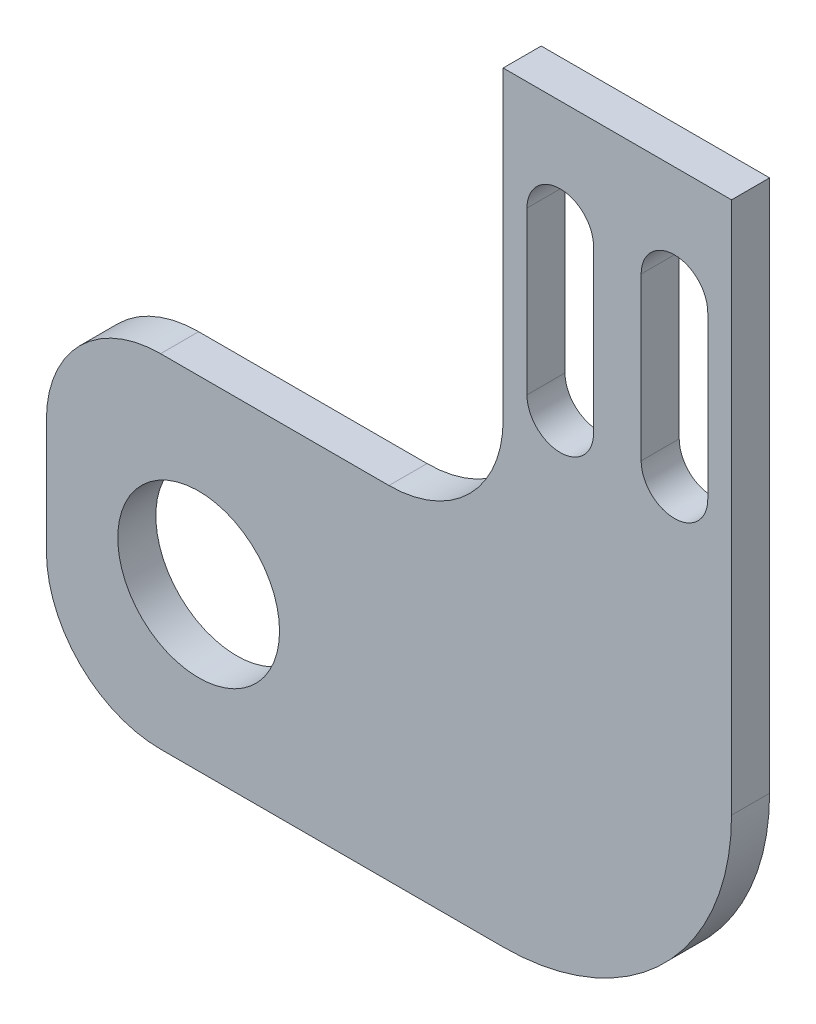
ISO-10303-21;
HEADER;
FILE_DESCRIPTION(('STEP AP214'),'2;1');
FILE_NAME('part.step','',(''),(''),'','','');
FILE_SCHEMA(('AUTOMOTIVE_DESIGN { 1 0 10303 214 1 1 1 1 }'));
ENDSEC;
DATA;
#1=APPLICATION_CONTEXT('core data for automotive mechanical design processes');
#2=APPLICATION_PROTOCOL_DEFINITION('international standard','automotive_design',2000,#1);
#3=PRODUCT_CONTEXT('',#1,'mechanical');
#4=PRODUCT('Part','Part','',(#3));
#5=PRODUCT_RELATED_PRODUCT_CATEGORY('part','',(#4));
#6=PRODUCT_DEFINITION_FORMATION('','',#4);
#7=PRODUCT_DEFINITION_CONTEXT('part definition',#1,'design');
#8=PRODUCT_DEFINITION('design','',#6,#7);
#9=PRODUCT_DEFINITION_SHAPE('','',#8);
#10=(LENGTH_UNIT() NAMED_UNIT(*) SI_UNIT(.MILLI.,.METRE.));
#11=(NAMED_UNIT(*) PLANE_ANGLE_UNIT() SI_UNIT($,.RADIAN.));
#12=(NAMED_UNIT(*) SI_UNIT($,.STERADIAN.) SOLID_ANGLE_UNIT());
#13=UNCERTAINTY_MEASURE_WITH_UNIT(LENGTH_MEASURE(1.E-05),#10,'distance_accuracy_value','');
#14=(GEOMETRIC_REPRESENTATION_CONTEXT(3) GLOBAL_UNCERTAINTY_ASSIGNED_CONTEXT((#13)) GLOBAL_UNIT_ASSIGNED_CONTEXT((#10,
#11,#12)) REPRESENTATION_CONTEXT('',''));
#15=CARTESIAN_POINT('',(0.,0.,0.));
#16=DIRECTION('',(0.,0.,1.));
#17=DIRECTION('',(1.,0.,0.));
#18=AXIS2_PLACEMENT_3D('',#15,#16,#17);
#19=CARTESIAN_POINT('',(-2.,20.,-2.));
#20=DIRECTION('',(1.,0.,0.));
#21=DIRECTION('',(0.,0.,-1.));
#22=AXIS2_PLACEMENT_3D('',#19,#20,#21);
#23=PLANE('',#22);
#24=DIRECTION('',(0.,1.,0.));
#25=VECTOR('',#24,1.);
#26=CARTESIAN_POINT('',(-2.,20.,0.));
#27=LINE('',#26,#25);
#28=CARTESIAN_POINT('',(-2.,-8.,0.));
#29=VERTEX_POINT('',#28);
#30=CARTESIAN_POINT('',(-2.,20.,0.));
#31=VERTEX_POINT('',#30);
#32=EDGE_CURVE('E208',#29,#31,#27,.T.);
#33=ORIENTED_EDGE('',*,*,#32,.F.);
#34=DIRECTION('',(0.,0.,1.));
#35=VECTOR('',#34,1.);
#36=CARTESIAN_POINT('',(-2.,-8.,-2.));
#37=LINE('',#36,#35);
#38=CARTESIAN_POINT('',(-2.,-8.,-2.));
#39=VERTEX_POINT('',#38);
#40=EDGE_CURVE('E24',#29,#39,#37,.F.);
#41=ORIENTED_EDGE('',*,*,#40,.T.);
#42=DIRECTION('',(0.,1.,0.));
#43=VECTOR('',#42,1.);
#44=CARTESIAN_POINT('',(-2.,20.,-2.));
#45=LINE('',#44,#43);
#46=CARTESIAN_POINT('',(-2.,20.,-2.));
#47=VERTEX_POINT('',#46);
#48=EDGE_CURVE('E209',#39,#47,#45,.T.);
#49=ORIENTED_EDGE('',*,*,#48,.T.);
#50=DIRECTION('',(0.,0.,1.));
#51=VECTOR('',#50,1.);
#52=CARTESIAN_POINT('',(-2.,20.,-2.));
#53=LINE('',#52,#51);
#54=EDGE_CURVE('E227',#47,#31,#53,.T.);
#55=ORIENTED_EDGE('',*,*,#54,.T.);
#56=EDGE_LOOP('',(#33,#41,#49,#55));
#57=FACE_BOUND('',#56,.T.);
#58=ADVANCED_FACE('F16',(#57),#23,.T.);
#59=CARTESIAN_POINT('',(-2.,-20.,-2.));
#60=DIRECTION('',(0.,-1.,0.));
#61=DIRECTION('',(0.,0.,-1.));
#62=AXIS2_PLACEMENT_3D('',#59,#60,#61);
#63=PLANE('',#62);
#64=DIRECTION('',(1.,0.,0.));
#65=VECTOR('',#64,1.);
#66=CARTESIAN_POINT('',(-2.,-20.,-2.));
#67=LINE('',#66,#65);
#68=CARTESIAN_POINT('',(-32.,-20.,-2.));
#69=VERTEX_POINT('',#68);
#70=CARTESIAN_POINT('',(-14.,-20.,-2.));
#71=VERTEX_POINT('',#70);
#72=EDGE_CURVE('E224',#69,#71,#67,.T.);
#73=ORIENTED_EDGE('',*,*,#72,.T.);
#74=DIRECTION('',(0.,0.,1.));
#75=VECTOR('',#74,1.);
#76=CARTESIAN_POINT('',(-14.,-20.,-2.));
#77=LINE('',#76,#75);
#78=CARTESIAN_POINT('',(-14.,-20.,0.));
#79=VERTEX_POINT('',#78);
#80=EDGE_CURVE('E274',#71,#79,#77,.T.);
#81=ORIENTED_EDGE('',*,*,#80,.T.);
#82=DIRECTION('',(1.,0.,0.));
#83=VECTOR('',#82,1.);
#84=CARTESIAN_POINT('',(-2.,-20.,0.));
#85=LINE('',#84,#83);
#86=CARTESIAN_POINT('',(-32.,-20.,0.));
#87=VERTEX_POINT('',#86);
#88=EDGE_CURVE('E212',#87,#79,#85,.T.);
#89=ORIENTED_EDGE('',*,*,#88,.F.);
#90=DIRECTION('',(0.,0.,1.));
#91=VECTOR('',#90,1.);
#92=CARTESIAN_POINT('',(-32.,-20.,-2.));
#93=LINE('',#92,#91);
#94=EDGE_CURVE('E268',#87,#69,#93,.F.);
#95=ORIENTED_EDGE('',*,*,#94,.T.);
#96=EDGE_LOOP('',(#73,#81,#89,#95));
#97=FACE_BOUND('',#96,.T.);
#98=ADVANCED_FACE('F292',(#97),#63,.T.);
#99=CARTESIAN_POINT('',(-38.,-2.,-2.));
#100=DIRECTION('',(-1.,0.,0.));
#101=DIRECTION('',(0.,-1.,0.));
#102=AXIS2_PLACEMENT_3D('',#99,#100,#101);
#103=PLANE('',#102);
#104=DIRECTION('',(0.,-1.,0.));
#105=VECTOR('',#104,1.);
#106=CARTESIAN_POINT('',(-38.,-2.,0.));
#107=LINE('',#106,#105);
#108=CARTESIAN_POINT('',(-38.,-8.,0.));
#109=VERTEX_POINT('',#108);
#110=CARTESIAN_POINT('',(-38.,-14.,0.));
#111=VERTEX_POINT('',#110);
#112=EDGE_CURVE('E238',#109,#111,#107,.T.);
#113=ORIENTED_EDGE('',*,*,#112,.F.);
#114=DIRECTION('',(0.,0.,1.));
#115=VECTOR('',#114,1.);
#116=CARTESIAN_POINT('',(-38.,-8.,-2.));
#117=LINE('',#116,#115);
#118=CARTESIAN_POINT('',(-38.,-8.,-2.));
#119=VERTEX_POINT('',#118);
#120=EDGE_CURVE('E262',#109,#119,#117,.F.);
#121=ORIENTED_EDGE('',*,*,#120,.T.);
#122=DIRECTION('',(0.,-1.,0.));
#123=VECTOR('',#122,1.);
#124=CARTESIAN_POINT('',(-38.,-2.,-2.));
#125=LINE('',#124,#123);
#126=CARTESIAN_POINT('',(-38.,-14.,-2.));
#127=VERTEX_POINT('',#126);
#128=EDGE_CURVE('E221',#119,#127,#125,.T.);
#129=ORIENTED_EDGE('',*,*,#128,.T.);
#130=DIRECTION('',(0.,0.,1.));
#131=VECTOR('',#130,1.);
#132=CARTESIAN_POINT('',(-38.,-14.,-2.));
#133=LINE('',#132,#131);
#134=EDGE_CURVE('E259',#127,#111,#133,.T.);
#135=ORIENTED_EDGE('',*,*,#134,.T.);
#136=EDGE_LOOP('',(#113,#121,#129,#135));
#137=FACE_BOUND('',#136,.T.);
#138=ADVANCED_FACE('F302',(#137),#103,.T.);
#139=CARTESIAN_POINT('',(-38.,-2.,-2.));
#140=DIRECTION('',(0.,1.,0.));
#141=DIRECTION('',(0.,0.,1.));
#142=AXIS2_PLACEMENT_3D('',#139,#140,#141);
#143=PLANE('',#142);
#144=DIRECTION('',(-1.,0.,0.));
#145=VECTOR('',#144,1.);
#146=CARTESIAN_POINT('',(-38.,-2.,0.));
#147=LINE('',#146,#145);
#148=CARTESIAN_POINT('',(-20.,-2.,0.));
#149=VERTEX_POINT('',#148);
#150=CARTESIAN_POINT('',(-32.,-2.,0.));
#151=VERTEX_POINT('',#150);
#152=EDGE_CURVE('E235',#149,#151,#147,.T.);
#153=ORIENTED_EDGE('',*,*,#152,.F.);
#154=DIRECTION('',(0.,0.,1.));
#155=VECTOR('',#154,1.);
#156=CARTESIAN_POINT('',(-20.,-2.,-2.));
#157=LINE('',#156,#155);
#158=CARTESIAN_POINT('',(-20.,-2.,-2.));
#159=VERTEX_POINT('',#158);
#160=EDGE_CURVE('E253',#149,#159,#157,.F.);
#161=ORIENTED_EDGE('',*,*,#160,.T.);
#162=DIRECTION('',(-1.,0.,0.));
#163=VECTOR('',#162,1.);
#164=CARTESIAN_POINT('',(-38.,-2.,-2.));
#165=LINE('',#164,#163);
#166=CARTESIAN_POINT('',(-32.,-2.,-2.));
#167=VERTEX_POINT('',#166);
#168=EDGE_CURVE('E218',#159,#167,#165,.T.);
#169=ORIENTED_EDGE('',*,*,#168,.T.);
#170=DIRECTION('',(0.,0.,1.));
#171=VECTOR('',#170,1.);
#172=CARTESIAN_POINT('',(-32.,-2.,-2.));
#173=LINE('',#172,#171);
#174=EDGE_CURVE('E250',#167,#151,#173,.T.);
#175=ORIENTED_EDGE('',*,*,#174,.T.);
#176=EDGE_LOOP('',(#153,#161,#169,#175));
#177=FACE_BOUND('',#176,.T.);
#178=ADVANCED_FACE('F312',(#177),#143,.T.);
#179=CARTESIAN_POINT('',(-14.,20.,-2.));
#180=DIRECTION('',(-1.,0.,0.));
#181=DIRECTION('',(0.,-1.,0.));
#182=AXIS2_PLACEMENT_3D('',#179,#180,#181);
#183=PLANE('',#182);
#184=DIRECTION('',(0.,-1.,0.));
#185=VECTOR('',#184,1.);
#186=CARTESIAN_POINT('',(-14.,20.,-2.));
#187=LINE('',#186,#185);
#188=CARTESIAN_POINT('',(-14.,20.,-2.));
#189=VERTEX_POINT('',#188);
#190=CARTESIAN_POINT('',(-14.,4.,-2.));
#191=VERTEX_POINT('',#190);
#192=EDGE_CURVE('E215',#189,#191,#187,.T.);
#193=ORIENTED_EDGE('',*,*,#192,.T.);
#194=DIRECTION('',(0.,0.,1.));
#195=VECTOR('',#194,1.);
#196=CARTESIAN_POINT('',(-14.,4.,0.));
#197=LINE('',#196,#195);
#198=CARTESIAN_POINT('',(-14.,4.,0.));
#199=VERTEX_POINT('',#198);
#200=EDGE_CURVE('E245',#191,#199,#197,.T.);
#201=ORIENTED_EDGE('',*,*,#200,.T.);
#202=DIRECTION('',(0.,-1.,0.));
#203=VECTOR('',#202,1.);
#204=CARTESIAN_POINT('',(-14.,20.,0.));
#205=LINE('',#204,#203);
#206=CARTESIAN_POINT('',(-14.,20.,0.));
#207=VERTEX_POINT('',#206);
#208=EDGE_CURVE('E232',#207,#199,#205,.T.);
#209=ORIENTED_EDGE('',*,*,#208,.F.);
#210=DIRECTION('',(0.,0.,1.));
#211=VECTOR('',#210,1.);
#212=CARTESIAN_POINT('',(-14.,20.,-2.));
#213=LINE('',#212,#211);
#214=EDGE_CURVE('E243',#189,#207,#213,.T.);
#215=ORIENTED_EDGE('',*,*,#214,.F.);
#216=EDGE_LOOP('',(#193,#201,#209,#215));
#217=FACE_BOUND('',#216,.T.);
#218=ADVANCED_FACE('F320',(#217),#183,.T.);
#219=CARTESIAN_POINT('',(-2.,20.,-2.));
#220=DIRECTION('',(0.,1.,0.));
#221=DIRECTION('',(-1.,0.,0.));
#222=AXIS2_PLACEMENT_3D('',#219,#220,#221);
#223=PLANE('',#222);
#224=DIRECTION('',(-1.,0.,0.));
#225=VECTOR('',#224,1.);
#226=CARTESIAN_POINT('',(-2.,20.,0.));
#227=LINE('',#226,#225);
#228=EDGE_CURVE('E229',#31,#207,#227,.T.);
#229=ORIENTED_EDGE('',*,*,#228,.F.);
#230=ORIENTED_EDGE('',*,*,#54,.F.);
#231=DIRECTION('',(-1.,0.,0.));
#232=VECTOR('',#231,1.);
#233=CARTESIAN_POINT('',(-2.,20.,-2.));
#234=LINE('',#233,#232);
#235=EDGE_CURVE('E211',#47,#189,#234,.T.);
#236=ORIENTED_EDGE('',*,*,#235,.T.);
#237=ORIENTED_EDGE('',*,*,#214,.T.);
#238=EDGE_LOOP('',(#229,#230,#236,#237));
#239=FACE_BOUND('',#238,.T.);
#240=ADVANCED_FACE('F323',(#239),#223,.T.);
#241=CARTESIAN_POINT('',(0.,0.,-2.));
#242=DIRECTION('',(0.,0.,-1.));
#243=DIRECTION('',(-1.,0.,0.));
#244=AXIS2_PLACEMENT_3D('',#241,#242,#243);
#245=PLANE('',#244);
#246=DIRECTION('',(0.,1.,0.));
#247=VECTOR('',#246,1.);
#248=CARTESIAN_POINT('',(-12.75,5.75,-2.));
#249=LINE('',#248,#247);
#250=CARTESIAN_POINT('',(-12.75,5.75,-2.));
#251=VERTEX_POINT('',#250);
#252=CARTESIAN_POINT('',(-12.75,14.25,-2.));
#253=VERTEX_POINT('',#252);
#254=EDGE_CURVE('E142',#251,#253,#249,.T.);
#255=ORIENTED_EDGE('',*,*,#254,.F.);
#256=CARTESIAN_POINT('',(-11.,5.75,-2.));
#257=DIRECTION('',(0.,0.,1.));
#258=DIRECTION('',(1.,0.,0.));
#259=AXIS2_PLACEMENT_3D('',#256,#257,#258);
#260=CIRCLE('',#259,1.75);
#261=CARTESIAN_POINT('',(-9.25,5.75,-2.));
#262=VERTEX_POINT('',#261);
#263=EDGE_CURVE('E149',#251,#262,#260,.T.);
#264=ORIENTED_EDGE('',*,*,#263,.T.);
#265=DIRECTION('',(0.,1.,0.));
#266=VECTOR('',#265,1.);
#267=CARTESIAN_POINT('',(-9.25,5.75,-2.));
#268=LINE('',#267,#266);
#269=CARTESIAN_POINT('',(-9.25,14.25,-2.));
#270=VERTEX_POINT('',#269);
#271=EDGE_CURVE('E137',#262,#270,#268,.T.);
#272=ORIENTED_EDGE('',*,*,#271,.T.);
#273=CARTESIAN_POINT('',(-11.,14.25,-2.));
#274=DIRECTION('',(0.,0.,1.));
#275=DIRECTION('',(1.,0.,0.));
#276=AXIS2_PLACEMENT_3D('',#273,#274,#275);
#277=CIRCLE('',#276,1.75);
#278=EDGE_CURVE('E167',#270,#253,#277,.T.);
#279=ORIENTED_EDGE('',*,*,#278,.T.);
#280=EDGE_LOOP('',(#255,#264,#272,#279));
#281=FACE_BOUND('',#280,.T.);
#282=DIRECTION('',(0.,1.,0.));
#283=VECTOR('',#282,1.);
#284=CARTESIAN_POINT('',(-6.75,5.75,-2.));
#285=LINE('',#284,#283);
#286=CARTESIAN_POINT('',(-6.75,5.75,-2.));
#287=VERTEX_POINT('',#286);
#288=CARTESIAN_POINT('',(-6.75,14.25,-2.));
#289=VERTEX_POINT('',#288);
#290=EDGE_CURVE('E176',#287,#289,#285,.T.);
#291=ORIENTED_EDGE('',*,*,#290,.F.);
#292=CARTESIAN_POINT('',(-5.,5.75,-2.));
#293=DIRECTION('',(0.,0.,1.));
#294=DIRECTION('',(1.,0.,0.));
#295=AXIS2_PLACEMENT_3D('',#292,#293,#294);
#296=CIRCLE('',#295,1.75);
#297=CARTESIAN_POINT('',(-3.25,5.75,-2.));
#298=VERTEX_POINT('',#297);
#299=EDGE_CURVE('E187',#287,#298,#296,.T.);
#300=ORIENTED_EDGE('',*,*,#299,.T.);
#301=DIRECTION('',(0.,1.,0.));
#302=VECTOR('',#301,1.);
#303=CARTESIAN_POINT('',(-3.25,5.75,-2.));
#304=LINE('',#303,#302);
#305=CARTESIAN_POINT('',(-3.25,14.25,-2.));
#306=VERTEX_POINT('',#305);
#307=EDGE_CURVE('E173',#298,#306,#304,.T.);
#308=ORIENTED_EDGE('',*,*,#307,.T.);
#309=CARTESIAN_POINT('',(-5.,14.25,-2.));
#310=DIRECTION('',(0.,0.,1.));
#311=DIRECTION('',(1.,0.,0.));
#312=AXIS2_PLACEMENT_3D('',#309,#310,#311);
#313=CIRCLE('',#312,1.75);
#314=EDGE_CURVE('E197',#306,#289,#313,.T.);
#315=ORIENTED_EDGE('',*,*,#314,.T.);
#316=EDGE_LOOP('',(#291,#300,#308,#315));
#317=FACE_BOUND('',#316,.T.);
#318=CARTESIAN_POINT('',(-30.,-11.5,-2.));
#319=DIRECTION('',(0.,0.,1.));
#320=DIRECTION('',(1.,0.,0.));
#321=AXIS2_PLACEMENT_3D('',#318,#319,#320);
#322=CIRCLE('',#321,4.25);
#323=CARTESIAN_POINT('',(-25.75,-11.5,-2.));
#324=VERTEX_POINT('',#323);
#325=EDGE_CURVE('E205',#324,#324,#322,.T.);
#326=ORIENTED_EDGE('',*,*,#325,.T.);
#327=EDGE_LOOP('',(#326));
#328=FACE_BOUND('',#327,.T.);
#329=ORIENTED_EDGE('',*,*,#48,.F.);
#330=CARTESIAN_POINT('',(-14.,-8.,-2.));
#331=DIRECTION('',(0.,0.,-1.));
#332=DIRECTION('',(-1.,0.,0.));
#333=AXIS2_PLACEMENT_3D('',#330,#331,#332);
#334=CIRCLE('',#333,12.);
#335=EDGE_CURVE('E11',#39,#71,#334,.T.);
#336=ORIENTED_EDGE('',*,*,#335,.T.);
#337=ORIENTED_EDGE('',*,*,#72,.F.);
#338=CARTESIAN_POINT('',(-32.,-14.,-2.));
#339=DIRECTION('',(0.,0.,-1.));
#340=DIRECTION('',(-1.,0.,0.));
#341=AXIS2_PLACEMENT_3D('',#338,#339,#340);
#342=CIRCLE('',#341,6.);
#343=EDGE_CURVE('E264',#69,#127,#342,.T.);
#344=ORIENTED_EDGE('',*,*,#343,.T.);
#345=ORIENTED_EDGE('',*,*,#128,.F.);
#346=CARTESIAN_POINT('',(-32.,-8.,-2.));
#347=DIRECTION('',(0.,0.,-1.));
#348=DIRECTION('',(-1.,0.,0.));
#349=AXIS2_PLACEMENT_3D('',#346,#347,#348);
#350=CIRCLE('',#349,6.);
#351=EDGE_CURVE('E266',#119,#167,#350,.T.);
#352=ORIENTED_EDGE('',*,*,#351,.T.);
#353=ORIENTED_EDGE('',*,*,#168,.F.);
#354=CARTESIAN_POINT('',(-20.,4.,-2.));
#355=DIRECTION('',(0.,0.,-1.));
#356=DIRECTION('',(-1.,0.,0.));
#357=AXIS2_PLACEMENT_3D('',#354,#355,#356);
#358=CIRCLE('',#357,6.);
#359=EDGE_CURVE('E272',#159,#191,#358,.F.);
#360=ORIENTED_EDGE('',*,*,#359,.T.);
#361=ORIENTED_EDGE('',*,*,#192,.F.);
#362=ORIENTED_EDGE('',*,*,#235,.F.);
#363=EDGE_LOOP('',(#329,#336,#337,#344,#345,#352,#353,#360,#361,#362));
#364=FACE_BOUND('',#363,.T.);
#365=ADVANCED_FACE('F156',(#281,#317,#328,#364),#245,.T.);
#366=CARTESIAN_POINT('',(0.,0.,0.));
#367=DIRECTION('',(0.,0.,-1.));
#368=DIRECTION('',(-1.,0.,0.));
#369=AXIS2_PLACEMENT_3D('',#366,#367,#368);
#370=PLANE('',#369);
#371=CARTESIAN_POINT('',(-11.,5.75,0.));
#372=DIRECTION('',(0.,0.,1.));
#373=DIRECTION('',(1.,0.,0.));
#374=AXIS2_PLACEMENT_3D('',#371,#372,#373);
#375=CIRCLE('',#374,1.75);
#376=CARTESIAN_POINT('',(-12.75,5.75,0.));
#377=VERTEX_POINT('',#376);
#378=CARTESIAN_POINT('',(-9.25,5.75,0.));
#379=VERTEX_POINT('',#378);
#380=EDGE_CURVE('E152',#377,#379,#375,.T.);
#381=ORIENTED_EDGE('',*,*,#380,.F.);
#382=DIRECTION('',(0.,1.,0.));
#383=VECTOR('',#382,1.);
#384=CARTESIAN_POINT('',(-12.75,5.75,0.));
#385=LINE('',#384,#383);
#386=CARTESIAN_POINT('',(-12.75,14.25,0.));
#387=VERTEX_POINT('',#386);
#388=EDGE_CURVE('E154',#377,#387,#385,.T.);
#389=ORIENTED_EDGE('',*,*,#388,.T.);
#390=CARTESIAN_POINT('',(-11.,14.25,0.));
#391=DIRECTION('',(0.,0.,1.));
#392=DIRECTION('',(1.,0.,0.));
#393=AXIS2_PLACEMENT_3D('',#390,#391,#392);
#394=CIRCLE('',#393,1.75);
#395=CARTESIAN_POINT('',(-9.25,14.25,0.));
#396=VERTEX_POINT('',#395);
#397=EDGE_CURVE('E164',#396,#387,#394,.T.);
#398=ORIENTED_EDGE('',*,*,#397,.F.);
#399=DIRECTION('',(0.,1.,0.));
#400=VECTOR('',#399,1.);
#401=CARTESIAN_POINT('',(-9.25,5.75,0.));
#402=LINE('',#401,#400);
#403=EDGE_CURVE('E143',#379,#396,#402,.T.);
#404=ORIENTED_EDGE('',*,*,#403,.F.);
#405=EDGE_LOOP('',(#381,#389,#398,#404));
#406=FACE_BOUND('',#405,.T.);
#407=CARTESIAN_POINT('',(-5.,5.75,0.));
#408=DIRECTION('',(0.,0.,1.));
#409=DIRECTION('',(1.,0.,0.));
#410=AXIS2_PLACEMENT_3D('',#407,#408,#409);
#411=CIRCLE('',#410,1.75);
#412=CARTESIAN_POINT('',(-6.75,5.75,0.));
#413=VERTEX_POINT('',#412);
#414=CARTESIAN_POINT('',(-3.25,5.75,0.));
#415=VERTEX_POINT('',#414);
#416=EDGE_CURVE('E184',#413,#415,#411,.T.);
#417=ORIENTED_EDGE('',*,*,#416,.F.);
#418=DIRECTION('',(0.,1.,0.));
#419=VECTOR('',#418,1.);
#420=CARTESIAN_POINT('',(-6.75,5.75,0.));
#421=LINE('',#420,#419);
#422=CARTESIAN_POINT('',(-6.75,14.25,0.));
#423=VERTEX_POINT('',#422);
#424=EDGE_CURVE('E178',#413,#423,#421,.T.);
#425=ORIENTED_EDGE('',*,*,#424,.T.);
#426=CARTESIAN_POINT('',(-5.,14.25,0.));
#427=DIRECTION('',(0.,0.,1.));
#428=DIRECTION('',(1.,0.,0.));
#429=AXIS2_PLACEMENT_3D('',#426,#427,#428);
#430=CIRCLE('',#429,1.75);
#431=CARTESIAN_POINT('',(-3.25,14.25,0.));
#432=VERTEX_POINT('',#431);
#433=EDGE_CURVE('E194',#432,#423,#430,.T.);
#434=ORIENTED_EDGE('',*,*,#433,.F.);
#435=DIRECTION('',(0.,1.,0.));
#436=VECTOR('',#435,1.);
#437=CARTESIAN_POINT('',(-3.25,5.75,0.));
#438=LINE('',#437,#436);
#439=EDGE_CURVE('E171',#415,#432,#438,.T.);
#440=ORIENTED_EDGE('',*,*,#439,.F.);
#441=EDGE_LOOP('',(#417,#425,#434,#440));
#442=FACE_BOUND('',#441,.T.);
#443=CARTESIAN_POINT('',(-30.,-11.5,0.));
#444=DIRECTION('',(0.,0.,1.));
#445=DIRECTION('',(1.,0.,0.));
#446=AXIS2_PLACEMENT_3D('',#443,#444,#445);
#447=CIRCLE('',#446,4.25);
#448=CARTESIAN_POINT('',(-25.75,-11.5,0.));
#449=VERTEX_POINT('',#448);
#450=EDGE_CURVE('E202',#449,#449,#447,.T.);
#451=ORIENTED_EDGE('',*,*,#450,.F.);
#452=EDGE_LOOP('',(#451));
#453=FACE_BOUND('',#452,.T.);
#454=ORIENTED_EDGE('',*,*,#88,.T.);
#455=CARTESIAN_POINT('',(-14.,-8.,0.));
#456=DIRECTION('',(0.,0.,-1.));
#457=DIRECTION('',(-1.,0.,0.));
#458=AXIS2_PLACEMENT_3D('',#455,#456,#457);
#459=CIRCLE('',#458,12.);
#460=EDGE_CURVE('E277',#79,#29,#459,.F.);
#461=ORIENTED_EDGE('',*,*,#460,.T.);
#462=ORIENTED_EDGE('',*,*,#32,.T.);
#463=ORIENTED_EDGE('',*,*,#228,.T.);
#464=ORIENTED_EDGE('',*,*,#208,.T.);
#465=CARTESIAN_POINT('',(-20.,4.,0.));
#466=DIRECTION('',(0.,0.,-1.));
#467=DIRECTION('',(-1.,0.,0.));
#468=AXIS2_PLACEMENT_3D('',#465,#466,#467);
#469=CIRCLE('',#468,6.);
#470=EDGE_CURVE('E270',#199,#149,#469,.T.);
#471=ORIENTED_EDGE('',*,*,#470,.T.);
#472=ORIENTED_EDGE('',*,*,#152,.T.);
#473=CARTESIAN_POINT('',(-32.,-8.,0.));
#474=DIRECTION('',(0.,0.,-1.));
#475=DIRECTION('',(-1.,0.,0.));
#476=AXIS2_PLACEMENT_3D('',#473,#474,#475);
#477=CIRCLE('',#476,6.);
#478=EDGE_CURVE('E257',#151,#109,#477,.F.);
#479=ORIENTED_EDGE('',*,*,#478,.T.);
#480=ORIENTED_EDGE('',*,*,#112,.T.);
#481=CARTESIAN_POINT('',(-32.,-14.,0.));
#482=DIRECTION('',(0.,0.,-1.));
#483=DIRECTION('',(-1.,0.,0.));
#484=AXIS2_PLACEMENT_3D('',#481,#482,#483);
#485=CIRCLE('',#484,6.);
#486=EDGE_CURVE('E255',#111,#87,#485,.F.);
#487=ORIENTED_EDGE('',*,*,#486,.T.);
#488=EDGE_LOOP('',(#454,#461,#462,#463,#464,#471,#472,#479,#480,#487));
#489=FACE_BOUND('',#488,.T.);
#490=ADVANCED_FACE('F295',(#406,#442,#453,#489),#370,.F.);
#491=CARTESIAN_POINT('',(-20.,4.,-2.));
#492=DIRECTION('',(0.,0.,-1.));
#493=DIRECTION('',(-1.,0.,0.));
#494=AXIS2_PLACEMENT_3D('',#491,#492,#493);
#495=CYLINDRICAL_SURFACE('',#494,6.);
#496=ORIENTED_EDGE('',*,*,#359,.F.);
#497=ORIENTED_EDGE('',*,*,#160,.F.);
#498=ORIENTED_EDGE('',*,*,#470,.F.);
#499=ORIENTED_EDGE('',*,*,#200,.F.);
#500=EDGE_LOOP('',(#496,#497,#498,#499));
#501=FACE_BOUND('',#500,.T.);
#502=ADVANCED_FACE('F318',(#501),#495,.F.);
#503=CARTESIAN_POINT('',(-32.,-8.,-2.));
#504=DIRECTION('',(0.,0.,1.));
#505=DIRECTION('',(1.,0.,0.));
#506=AXIS2_PLACEMENT_3D('',#503,#504,#505);
#507=CYLINDRICAL_SURFACE('',#506,6.);
#508=ORIENTED_EDGE('',*,*,#351,.F.);
#509=ORIENTED_EDGE('',*,*,#120,.F.);
#510=ORIENTED_EDGE('',*,*,#478,.F.);
#511=ORIENTED_EDGE('',*,*,#174,.F.);
#512=EDGE_LOOP('',(#508,#509,#510,#511));
#513=FACE_BOUND('',#512,.T.);
#514=ADVANCED_FACE('F309',(#513),#507,.T.);
#515=CARTESIAN_POINT('',(-32.,-14.,-2.));
#516=DIRECTION('',(0.,0.,1.));
#517=DIRECTION('',(1.,0.,0.));
#518=AXIS2_PLACEMENT_3D('',#515,#516,#517);
#519=CYLINDRICAL_SURFACE('',#518,6.);
#520=ORIENTED_EDGE('',*,*,#343,.F.);
#521=ORIENTED_EDGE('',*,*,#94,.F.);
#522=ORIENTED_EDGE('',*,*,#486,.F.);
#523=ORIENTED_EDGE('',*,*,#134,.F.);
#524=EDGE_LOOP('',(#520,#521,#522,#523));
#525=FACE_BOUND('',#524,.T.);
#526=ADVANCED_FACE('F300',(#525),#519,.T.);
#527=CARTESIAN_POINT('',(-14.,-8.,-2.));
#528=DIRECTION('',(0.,0.,1.));
#529=DIRECTION('',(1.,0.,0.));
#530=AXIS2_PLACEMENT_3D('',#527,#528,#529);
#531=CYLINDRICAL_SURFACE('',#530,12.);
#532=ORIENTED_EDGE('',*,*,#335,.F.);
#533=ORIENTED_EDGE('',*,*,#40,.F.);
#534=ORIENTED_EDGE('',*,*,#460,.F.);
#535=ORIENTED_EDGE('',*,*,#80,.F.);
#536=EDGE_LOOP('',(#532,#533,#534,#535));
#537=FACE_BOUND('',#536,.T.);
#538=ADVANCED_FACE('F18',(#537),#531,.T.);
#539=CARTESIAN_POINT('',(-30.,-11.5,0.));
#540=DIRECTION('',(0.,0.,1.));
#541=DIRECTION('',(1.,0.,0.));
#542=AXIS2_PLACEMENT_3D('',#539,#540,#541);
#543=CYLINDRICAL_SURFACE('',#542,4.25);
#544=ORIENTED_EDGE('',*,*,#325,.F.);
#545=EDGE_LOOP('',(#544));
#546=FACE_BOUND('',#545,.T.);
#547=ORIENTED_EDGE('',*,*,#450,.T.);
#548=EDGE_LOOP('',(#547));
#549=FACE_BOUND('',#548,.T.);
#550=ADVANCED_FACE('F350',(#546,#549),#543,.F.);
#551=CARTESIAN_POINT('',(-5.,14.25,0.));
#552=DIRECTION('',(0.,0.,1.));
#553=DIRECTION('',(1.,0.,0.));
#554=AXIS2_PLACEMENT_3D('',#551,#552,#553);
#555=CYLINDRICAL_SURFACE('',#554,1.75);
#556=ORIENTED_EDGE('',*,*,#314,.F.);
#557=DIRECTION('',(0.,0.,-1.));
#558=VECTOR('',#557,1.);
#559=CARTESIAN_POINT('',(-3.25,14.25,-2.));
#560=LINE('',#559,#558);
#561=EDGE_CURVE('E192',#432,#306,#560,.T.);
#562=ORIENTED_EDGE('',*,*,#561,.F.);
#563=ORIENTED_EDGE('',*,*,#433,.T.);
#564=DIRECTION('',(0.,0.,1.));
#565=VECTOR('',#564,1.);
#566=CARTESIAN_POINT('',(-6.75,14.25,0.));
#567=LINE('',#566,#565);
#568=EDGE_CURVE('E200',#289,#423,#567,.T.);
#569=ORIENTED_EDGE('',*,*,#568,.F.);
#570=EDGE_LOOP('',(#556,#562,#563,#569));
#571=FACE_BOUND('',#570,.T.);
#572=ADVANCED_FACE('F355',(#571),#555,.F.);
#573=CARTESIAN_POINT('',(-5.,5.75,0.));
#574=DIRECTION('',(0.,0.,1.));
#575=DIRECTION('',(1.,0.,0.));
#576=AXIS2_PLACEMENT_3D('',#573,#574,#575);
#577=CYLINDRICAL_SURFACE('',#576,1.75);
#578=ORIENTED_EDGE('',*,*,#416,.T.);
#579=DIRECTION('',(0.,0.,-1.));
#580=VECTOR('',#579,1.);
#581=CARTESIAN_POINT('',(-3.25,5.75,-2.));
#582=LINE('',#581,#580);
#583=EDGE_CURVE('E181',#415,#298,#582,.T.);
#584=ORIENTED_EDGE('',*,*,#583,.T.);
#585=ORIENTED_EDGE('',*,*,#299,.F.);
#586=DIRECTION('',(0.,0.,1.));
#587=VECTOR('',#586,1.);
#588=CARTESIAN_POINT('',(-6.75,5.75,0.));
#589=LINE('',#588,#587);
#590=EDGE_CURVE('E190',#413,#287,#589,.F.);
#591=ORIENTED_EDGE('',*,*,#590,.F.);
#592=EDGE_LOOP('',(#578,#584,#585,#591));
#593=FACE_BOUND('',#592,.T.);
#594=ADVANCED_FACE('F362',(#593),#577,.F.);
#595=CARTESIAN_POINT('',(-6.75,5.75,0.));
#596=DIRECTION('',(-1.,0.,0.));
#597=DIRECTION('',(0.,-1.,0.));
#598=AXIS2_PLACEMENT_3D('',#595,#596,#597);
#599=PLANE('',#598);
#600=ORIENTED_EDGE('',*,*,#568,.T.);
#601=ORIENTED_EDGE('',*,*,#424,.F.);
#602=ORIENTED_EDGE('',*,*,#590,.T.);
#603=ORIENTED_EDGE('',*,*,#290,.T.);
#604=EDGE_LOOP('',(#600,#601,#602,#603));
#605=FACE_BOUND('',#604,.T.);
#606=ADVANCED_FACE('F444',(#605),#599,.F.);
#607=CARTESIAN_POINT('',(-3.25,5.75,-2.));
#608=DIRECTION('',(1.,0.,0.));
#609=DIRECTION('',(0.,0.,-1.));
#610=AXIS2_PLACEMENT_3D('',#607,#608,#609);
#611=PLANE('',#610);
#612=ORIENTED_EDGE('',*,*,#561,.T.);
#613=ORIENTED_EDGE('',*,*,#307,.F.);
#614=ORIENTED_EDGE('',*,*,#583,.F.);
#615=ORIENTED_EDGE('',*,*,#439,.T.);
#616=EDGE_LOOP('',(#612,#613,#614,#615));
#617=FACE_BOUND('',#616,.T.);
#618=ADVANCED_FACE('F453',(#617),#611,.F.);
#619=CARTESIAN_POINT('',(-11.,14.25,0.));
#620=DIRECTION('',(0.,0.,1.));
#621=DIRECTION('',(1.,0.,0.));
#622=AXIS2_PLACEMENT_3D('',#619,#620,#621);
#623=CYLINDRICAL_SURFACE('',#622,1.75);
#624=ORIENTED_EDGE('',*,*,#278,.F.);
#625=DIRECTION('',(0.,0.,-1.));
#626=VECTOR('',#625,1.);
#627=CARTESIAN_POINT('',(-9.25,14.25,-2.));
#628=LINE('',#627,#626);
#629=EDGE_CURVE('E31',#396,#270,#628,.T.);
#630=ORIENTED_EDGE('',*,*,#629,.F.);
#631=ORIENTED_EDGE('',*,*,#397,.T.);
#632=DIRECTION('',(0.,0.,1.));
#633=VECTOR('',#632,1.);
#634=CARTESIAN_POINT('',(-12.75,14.25,0.));
#635=LINE('',#634,#633);
#636=EDGE_CURVE('E169',#253,#387,#635,.T.);
#637=ORIENTED_EDGE('',*,*,#636,.F.);
#638=EDGE_LOOP('',(#624,#630,#631,#637));
#639=FACE_BOUND('',#638,.T.);
#640=ADVANCED_FACE('F463',(#639),#623,.F.);
#641=CARTESIAN_POINT('',(-11.,5.75,0.));
#642=DIRECTION('',(0.,0.,1.));
#643=DIRECTION('',(1.,0.,0.));
#644=AXIS2_PLACEMENT_3D('',#641,#642,#643);
#645=CYLINDRICAL_SURFACE('',#644,1.75);
#646=ORIENTED_EDGE('',*,*,#380,.T.);
#647=DIRECTION('',(0.,0.,-1.));
#648=VECTOR('',#647,1.);
#649=CARTESIAN_POINT('',(-9.25,5.75,-2.));
#650=LINE('',#649,#648);
#651=EDGE_CURVE('E36',#379,#262,#650,.T.);
#652=ORIENTED_EDGE('',*,*,#651,.T.);
#653=ORIENTED_EDGE('',*,*,#263,.F.);
#654=DIRECTION('',(0.,0.,1.));
#655=VECTOR('',#654,1.);
#656=CARTESIAN_POINT('',(-12.75,5.75,0.));
#657=LINE('',#656,#655);
#658=EDGE_CURVE('E158',#377,#251,#657,.F.);
#659=ORIENTED_EDGE('',*,*,#658,.F.);
#660=EDGE_LOOP('',(#646,#652,#653,#659));
#661=FACE_BOUND('',#660,.T.);
#662=ADVANCED_FACE('F147',(#661),#645,.F.);
#663=CARTESIAN_POINT('',(-12.75,5.75,0.));
#664=DIRECTION('',(-1.,0.,0.));
#665=DIRECTION('',(0.,0.,1.));
#666=AXIS2_PLACEMENT_3D('',#663,#664,#665);
#667=PLANE('',#666);
#668=ORIENTED_EDGE('',*,*,#636,.T.);
#669=ORIENTED_EDGE('',*,*,#388,.F.);
#670=ORIENTED_EDGE('',*,*,#658,.T.);
#671=ORIENTED_EDGE('',*,*,#254,.T.);
#672=EDGE_LOOP('',(#668,#669,#670,#671));
#673=FACE_BOUND('',#672,.T.);
#674=ADVANCED_FACE('F482',(#673),#667,.F.);
#675=CARTESIAN_POINT('',(-9.25,5.75,-2.));
#676=DIRECTION('',(1.,0.,0.));
#677=DIRECTION('',(0.,0.,-1.));
#678=AXIS2_PLACEMENT_3D('',#675,#676,#677);
#679=PLANE('',#678);
#680=ORIENTED_EDGE('',*,*,#629,.T.);
#681=ORIENTED_EDGE('',*,*,#271,.F.);
#682=ORIENTED_EDGE('',*,*,#651,.F.);
#683=ORIENTED_EDGE('',*,*,#403,.T.);
#684=EDGE_LOOP('',(#680,#681,#682,#683));
#685=FACE_BOUND('',#684,.T.);
#686=ADVANCED_FACE('F138',(#685),#679,.F.);
#687=CLOSED_SHELL('',(#58,#98,#138,#178,#218,#240,#365,#490,#502,#514,#526,#538,#550,#572,#594,
#606,#618,#640,#662,#674,#686));
#688=MANIFOLD_SOLID_BREP('B1',#687);
#689=ADVANCED_BREP_SHAPE_REPRESENTATION('',(#18,#688),#14);
#690=SHAPE_DEFINITION_REPRESENTATION(#9,#689);
ENDSEC;
END-ISO-10303-21;
